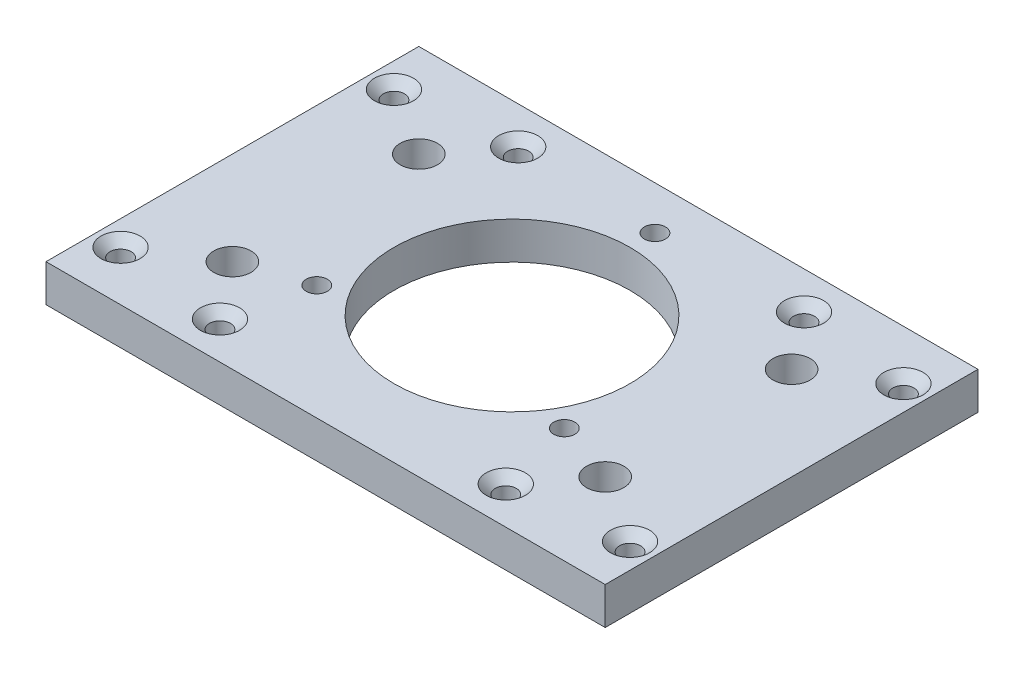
ISO-10303-21;
HEADER;
FILE_DESCRIPTION(('STEP AP214'),'2;1');
FILE_NAME('part.step','',(''),(''),'','','');
FILE_SCHEMA(('AUTOMOTIVE_DESIGN { 1 0 10303 214 1 1 1 1 }'));
ENDSEC;
DATA;
#1=APPLICATION_CONTEXT('core data for automotive mechanical design processes');
#2=APPLICATION_PROTOCOL_DEFINITION('international standard','automotive_design',2000,#1);
#3=PRODUCT_CONTEXT('',#1,'mechanical');
#4=PRODUCT('Part','Part','',(#3));
#5=PRODUCT_RELATED_PRODUCT_CATEGORY('part','',(#4));
#6=PRODUCT_DEFINITION_FORMATION('','',#4);
#7=PRODUCT_DEFINITION_CONTEXT('part definition',#1,'design');
#8=PRODUCT_DEFINITION('design','',#6,#7);
#9=PRODUCT_DEFINITION_SHAPE('','',#8);
#10=(LENGTH_UNIT() NAMED_UNIT(*) SI_UNIT(.MILLI.,.METRE.));
#11=(NAMED_UNIT(*) PLANE_ANGLE_UNIT() SI_UNIT($,.RADIAN.));
#12=(NAMED_UNIT(*) SI_UNIT($,.STERADIAN.) SOLID_ANGLE_UNIT());
#13=UNCERTAINTY_MEASURE_WITH_UNIT(LENGTH_MEASURE(1.E-05),#10,'distance_accuracy_value','');
#14=(GEOMETRIC_REPRESENTATION_CONTEXT(3) GLOBAL_UNCERTAINTY_ASSIGNED_CONTEXT((#13)) GLOBAL_UNIT_ASSIGNED_CONTEXT((#10,
#11,#12)) REPRESENTATION_CONTEXT('',''));
#15=CARTESIAN_POINT('',(0.,0.,0.));
#16=DIRECTION('',(0.,0.,1.));
#17=DIRECTION('',(1.,0.,0.));
#18=AXIS2_PLACEMENT_3D('',#15,#16,#17);
#19=CARTESIAN_POINT('',(45.,-3.,-30.));
#20=DIRECTION('',(0.,0.,1.));
#21=DIRECTION('',(1.,0.,0.));
#22=AXIS2_PLACEMENT_3D('',#19,#20,#21);
#23=PLANE('',#22);
#24=DIRECTION('',(0.,1.,0.));
#25=VECTOR('',#24,1.);
#26=CARTESIAN_POINT('',(-45.,-3.,-30.));
#27=LINE('',#26,#25);
#28=CARTESIAN_POINT('',(-45.,-3.,-30.));
#29=VERTEX_POINT('',#28);
#30=CARTESIAN_POINT('',(-45.,3.,-30.));
#31=VERTEX_POINT('',#30);
#32=EDGE_CURVE('E95',#29,#31,#27,.T.);
#33=ORIENTED_EDGE('',*,*,#32,.T.);
#34=DIRECTION('',(-1.,0.,0.));
#35=VECTOR('',#34,1.);
#36=CARTESIAN_POINT('',(45.,3.,-30.));
#37=LINE('',#36,#35);
#38=CARTESIAN_POINT('',(45.,3.,-30.));
#39=VERTEX_POINT('',#38);
#40=EDGE_CURVE('E11',#39,#31,#37,.T.);
#41=ORIENTED_EDGE('',*,*,#40,.F.);
#42=DIRECTION('',(0.,1.,0.));
#43=VECTOR('',#42,1.);
#44=CARTESIAN_POINT('',(45.,-3.,-30.));
#45=LINE('',#44,#43);
#46=CARTESIAN_POINT('',(45.,-3.,-30.));
#47=VERTEX_POINT('',#46);
#48=EDGE_CURVE('E83',#47,#39,#45,.T.);
#49=ORIENTED_EDGE('',*,*,#48,.F.);
#50=DIRECTION('',(-1.,0.,0.));
#51=VECTOR('',#50,1.);
#52=CARTESIAN_POINT('',(45.,-3.,-30.));
#53=LINE('',#52,#51);
#54=EDGE_CURVE('E91',#47,#29,#53,.T.);
#55=ORIENTED_EDGE('',*,*,#54,.T.);
#56=EDGE_LOOP('',(#33,#41,#49,#55));
#57=FACE_BOUND('',#56,.T.);
#58=ADVANCED_FACE('F32',(#57),#23,.F.);
#59=CARTESIAN_POINT('',(45.,3.,30.));
#60=DIRECTION('',(0.,-1.,0.));
#61=DIRECTION('',(0.,0.,-1.));
#62=AXIS2_PLACEMENT_3D('',#59,#60,#61);
#63=PLANE('',#62);
#64=CARTESIAN_POINT('',(-30.,3.,-15.));
#65=DIRECTION('',(0.,1.,0.));
#66=DIRECTION('',(0.,0.,1.));
#67=AXIS2_PLACEMENT_3D('',#64,#65,#66);
#68=CIRCLE('',#67,3.);
#69=CARTESIAN_POINT('',(-30.,3.,-12.));
#70=VERTEX_POINT('',#69);
#71=EDGE_CURVE('E234',#70,#70,#68,.T.);
#72=ORIENTED_EDGE('',*,*,#71,.F.);
#73=EDGE_LOOP('',(#72));
#74=FACE_BOUND('',#73,.T.);
#75=CARTESIAN_POINT('',(-30.,3.,15.));
#76=DIRECTION('',(0.,1.,0.));
#77=DIRECTION('',(0.,0.,1.));
#78=AXIS2_PLACEMENT_3D('',#75,#76,#77);
#79=CIRCLE('',#78,3.);
#80=CARTESIAN_POINT('',(-30.,3.,18.));
#81=VERTEX_POINT('',#80);
#82=EDGE_CURVE('E228',#81,#81,#79,.T.);
#83=ORIENTED_EDGE('',*,*,#82,.F.);
#84=EDGE_LOOP('',(#83));
#85=FACE_BOUND('',#84,.T.);
#86=CARTESIAN_POINT('',(30.,3.,15.));
#87=DIRECTION('',(0.,1.,0.));
#88=DIRECTION('',(0.,0.,1.));
#89=AXIS2_PLACEMENT_3D('',#86,#87,#88);
#90=CIRCLE('',#89,3.);
#91=CARTESIAN_POINT('',(30.,3.,18.));
#92=VERTEX_POINT('',#91);
#93=EDGE_CURVE('E222',#92,#92,#90,.T.);
#94=ORIENTED_EDGE('',*,*,#93,.F.);
#95=EDGE_LOOP('',(#94));
#96=FACE_BOUND('',#95,.T.);
#97=CARTESIAN_POINT('',(30.,3.,-15.));
#98=DIRECTION('',(0.,1.,0.));
#99=DIRECTION('',(0.,0.,1.));
#100=AXIS2_PLACEMENT_3D('',#97,#98,#99);
#101=CIRCLE('',#100,3.);
#102=CARTESIAN_POINT('',(30.,3.,-12.));
#103=VERTEX_POINT('',#102);
#104=EDGE_CURVE('E216',#103,#103,#101,.T.);
#105=ORIENTED_EDGE('',*,*,#104,.F.);
#106=EDGE_LOOP('',(#105));
#107=FACE_BOUND('',#106,.T.);
#108=CARTESIAN_POINT('',(-19.9185842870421,3.,11.5));
#109=DIRECTION('',(0.,-1.,0.));
#110=DIRECTION('',(0.,0.,-1.));
#111=AXIS2_PLACEMENT_3D('',#108,#109,#110);
#112=CIRCLE('',#111,1.7);
#113=CARTESIAN_POINT('',(-19.9185842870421,3.,9.79999999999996));
#114=VERTEX_POINT('',#113);
#115=EDGE_CURVE('E204',#114,#114,#112,.T.);
#116=ORIENTED_EDGE('',*,*,#115,.T.);
#117=EDGE_LOOP('',(#116));
#118=FACE_BOUND('',#117,.T.);
#119=CARTESIAN_POINT('',(19.9185842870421,3.,11.4999999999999));
#120=DIRECTION('',(0.,-1.,0.));
#121=DIRECTION('',(0.,0.,-1.));
#122=AXIS2_PLACEMENT_3D('',#119,#120,#121);
#123=CIRCLE('',#122,1.7);
#124=CARTESIAN_POINT('',(19.9185842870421,3.,9.79999999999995));
#125=VERTEX_POINT('',#124);
#126=EDGE_CURVE('E195',#125,#125,#123,.T.);
#127=ORIENTED_EDGE('',*,*,#126,.T.);
#128=EDGE_LOOP('',(#127));
#129=FACE_BOUND('',#128,.T.);
#130=CARTESIAN_POINT('',(0.,3.,-23.));
#131=DIRECTION('',(0.,-1.,0.));
#132=DIRECTION('',(0.,0.,-1.));
#133=AXIS2_PLACEMENT_3D('',#130,#131,#132);
#134=CIRCLE('',#133,1.7);
#135=CARTESIAN_POINT('',(0.,3.,-24.7));
#136=VERTEX_POINT('',#135);
#137=EDGE_CURVE('E186',#136,#136,#134,.T.);
#138=ORIENTED_EDGE('',*,*,#137,.T.);
#139=EDGE_LOOP('',(#138));
#140=FACE_BOUND('',#139,.T.);
#141=CARTESIAN_POINT('',(-41.,3.,-22.));
#142=DIRECTION('',(0.,1.,0.));
#143=DIRECTION('',(0.,0.,1.));
#144=AXIS2_PLACEMENT_3D('',#141,#142,#143);
#145=CIRCLE('',#144,3.15);
#146=CARTESIAN_POINT('',(-41.,3.,-18.85));
#147=VERTEX_POINT('',#146);
#148=EDGE_CURVE('E183',#147,#147,#145,.T.);
#149=ORIENTED_EDGE('',*,*,#148,.F.);
#150=EDGE_LOOP('',(#149));
#151=FACE_BOUND('',#150,.T.);
#152=CARTESIAN_POINT('',(41.,3.,-22.));
#153=DIRECTION('',(0.,1.,0.));
#154=DIRECTION('',(0.,0.,1.));
#155=AXIS2_PLACEMENT_3D('',#152,#153,#154);
#156=CIRCLE('',#155,3.15);
#157=CARTESIAN_POINT('',(41.,3.,-18.85));
#158=VERTEX_POINT('',#157);
#159=EDGE_CURVE('E174',#158,#158,#156,.T.);
#160=ORIENTED_EDGE('',*,*,#159,.F.);
#161=EDGE_LOOP('',(#160));
#162=FACE_BOUND('',#161,.T.);
#163=CARTESIAN_POINT('',(41.,3.,22.));
#164=DIRECTION('',(0.,1.,0.));
#165=DIRECTION('',(0.,0.,1.));
#166=AXIS2_PLACEMENT_3D('',#163,#164,#165);
#167=CIRCLE('',#166,3.15);
#168=CARTESIAN_POINT('',(41.,3.,25.15));
#169=VERTEX_POINT('',#168);
#170=EDGE_CURVE('E165',#169,#169,#167,.T.);
#171=ORIENTED_EDGE('',*,*,#170,.F.);
#172=EDGE_LOOP('',(#171));
#173=FACE_BOUND('',#172,.T.);
#174=CARTESIAN_POINT('',(-41.,3.,22.));
#175=DIRECTION('',(0.,1.,0.));
#176=DIRECTION('',(0.,0.,1.));
#177=AXIS2_PLACEMENT_3D('',#174,#175,#176);
#178=CIRCLE('',#177,3.15);
#179=CARTESIAN_POINT('',(-41.,3.,25.15));
#180=VERTEX_POINT('',#179);
#181=EDGE_CURVE('E156',#180,#180,#178,.T.);
#182=ORIENTED_EDGE('',*,*,#181,.F.);
#183=EDGE_LOOP('',(#182));
#184=FACE_BOUND('',#183,.T.);
#185=CARTESIAN_POINT('',(-23.,3.,-24.));
#186=DIRECTION('',(0.,1.,0.));
#187=DIRECTION('',(0.,0.,1.));
#188=AXIS2_PLACEMENT_3D('',#185,#186,#187);
#189=CIRCLE('',#188,3.15);
#190=CARTESIAN_POINT('',(-23.,3.,-20.85));
#191=VERTEX_POINT('',#190);
#192=EDGE_CURVE('E147',#191,#191,#189,.T.);
#193=ORIENTED_EDGE('',*,*,#192,.F.);
#194=EDGE_LOOP('',(#193));
#195=FACE_BOUND('',#194,.T.);
#196=CARTESIAN_POINT('',(23.,3.,-24.));
#197=DIRECTION('',(0.,1.,0.));
#198=DIRECTION('',(0.,0.,1.));
#199=AXIS2_PLACEMENT_3D('',#196,#197,#198);
#200=CIRCLE('',#199,3.15);
#201=CARTESIAN_POINT('',(23.,3.,-20.85));
#202=VERTEX_POINT('',#201);
#203=EDGE_CURVE('E138',#202,#202,#200,.T.);
#204=ORIENTED_EDGE('',*,*,#203,.F.);
#205=EDGE_LOOP('',(#204));
#206=FACE_BOUND('',#205,.T.);
#207=CARTESIAN_POINT('',(23.,3.,24.));
#208=DIRECTION('',(0.,1.,0.));
#209=DIRECTION('',(0.,0.,1.));
#210=AXIS2_PLACEMENT_3D('',#207,#208,#209);
#211=CIRCLE('',#210,3.15);
#212=CARTESIAN_POINT('',(23.,3.,27.15));
#213=VERTEX_POINT('',#212);
#214=EDGE_CURVE('E129',#213,#213,#211,.T.);
#215=ORIENTED_EDGE('',*,*,#214,.F.);
#216=EDGE_LOOP('',(#215));
#217=FACE_BOUND('',#216,.T.);
#218=CARTESIAN_POINT('',(-23.,3.,24.));
#219=DIRECTION('',(0.,1.,0.));
#220=DIRECTION('',(0.,0.,1.));
#221=AXIS2_PLACEMENT_3D('',#218,#219,#220);
#222=CIRCLE('',#221,3.15);
#223=CARTESIAN_POINT('',(-23.,3.,27.15));
#224=VERTEX_POINT('',#223);
#225=EDGE_CURVE('E120',#224,#224,#222,.T.);
#226=ORIENTED_EDGE('',*,*,#225,.F.);
#227=EDGE_LOOP('',(#226));
#228=FACE_BOUND('',#227,.T.);
#229=CARTESIAN_POINT('',(0.,3.,0.));
#230=DIRECTION('',(0.,1.,0.));
#231=DIRECTION('',(0.,0.,1.));
#232=AXIS2_PLACEMENT_3D('',#229,#230,#231);
#233=CIRCLE('',#232,19.);
#234=CARTESIAN_POINT('',(0.,3.,19.));
#235=VERTEX_POINT('',#234);
#236=EDGE_CURVE('E109',#235,#235,#233,.T.);
#237=ORIENTED_EDGE('',*,*,#236,.F.);
#238=EDGE_LOOP('',(#237));
#239=FACE_BOUND('',#238,.T.);
#240=DIRECTION('',(0.,0.,1.));
#241=VECTOR('',#240,1.);
#242=CARTESIAN_POINT('',(-45.,3.,30.));
#243=LINE('',#242,#241);
#244=CARTESIAN_POINT('',(-45.,3.,30.));
#245=VERTEX_POINT('',#244);
#246=EDGE_CURVE('E87',#31,#245,#243,.T.);
#247=ORIENTED_EDGE('',*,*,#246,.T.);
#248=DIRECTION('',(-1.,0.,0.));
#249=VECTOR('',#248,1.);
#250=CARTESIAN_POINT('',(45.,3.,30.));
#251=LINE('',#250,#249);
#252=CARTESIAN_POINT('',(45.,3.,30.));
#253=VERTEX_POINT('',#252);
#254=EDGE_CURVE('E40',#253,#245,#251,.T.);
#255=ORIENTED_EDGE('',*,*,#254,.F.);
#256=DIRECTION('',(0.,0.,1.));
#257=VECTOR('',#256,1.);
#258=CARTESIAN_POINT('',(45.,3.,30.));
#259=LINE('',#258,#257);
#260=EDGE_CURVE('E78',#39,#253,#259,.T.);
#261=ORIENTED_EDGE('',*,*,#260,.F.);
#262=ORIENTED_EDGE('',*,*,#40,.T.);
#263=EDGE_LOOP('',(#247,#255,#261,#262));
#264=FACE_BOUND('',#263,.T.);
#265=ADVANCED_FACE('F86',(#74,#85,#96,#107,#118,#129,#140,#151,#162,#173,#184,#195,#206,#217,
#228,#239,#264),#63,.F.);
#266=CARTESIAN_POINT('',(45.,-3.,30.));
#267=DIRECTION('',(0.,0.,-1.));
#268=DIRECTION('',(-1.,0.,0.));
#269=AXIS2_PLACEMENT_3D('',#266,#267,#268);
#270=PLANE('',#269);
#271=DIRECTION('',(0.,-1.,0.));
#272=VECTOR('',#271,1.);
#273=CARTESIAN_POINT('',(-45.,-3.,30.));
#274=LINE('',#273,#272);
#275=CARTESIAN_POINT('',(-45.,-3.,30.));
#276=VERTEX_POINT('',#275);
#277=EDGE_CURVE('E65',#245,#276,#274,.T.);
#278=ORIENTED_EDGE('',*,*,#277,.T.);
#279=DIRECTION('',(-1.,0.,0.));
#280=VECTOR('',#279,1.);
#281=CARTESIAN_POINT('',(45.,-3.,30.));
#282=LINE('',#281,#280);
#283=CARTESIAN_POINT('',(45.,-3.,30.));
#284=VERTEX_POINT('',#283);
#285=EDGE_CURVE('E88',#284,#276,#282,.T.);
#286=ORIENTED_EDGE('',*,*,#285,.F.);
#287=DIRECTION('',(0.,-1.,0.));
#288=VECTOR('',#287,1.);
#289=CARTESIAN_POINT('',(45.,-3.,30.));
#290=LINE('',#289,#288);
#291=EDGE_CURVE('E81',#253,#284,#290,.T.);
#292=ORIENTED_EDGE('',*,*,#291,.F.);
#293=ORIENTED_EDGE('',*,*,#254,.T.);
#294=EDGE_LOOP('',(#278,#286,#292,#293));
#295=FACE_BOUND('',#294,.T.);
#296=ADVANCED_FACE('F89',(#295),#270,.F.);
#297=CARTESIAN_POINT('',(45.,-3.,30.));
#298=DIRECTION('',(0.,1.,0.));
#299=DIRECTION('',(0.,0.,1.));
#300=AXIS2_PLACEMENT_3D('',#297,#298,#299);
#301=PLANE('',#300);
#302=CARTESIAN_POINT('',(-30.,-3.,-15.));
#303=DIRECTION('',(0.,1.,0.));
#304=DIRECTION('',(0.,0.,1.));
#305=AXIS2_PLACEMENT_3D('',#302,#303,#304);
#306=CIRCLE('',#305,3.);
#307=CARTESIAN_POINT('',(-30.,-3.,-12.));
#308=VERTEX_POINT('',#307);
#309=EDGE_CURVE('E231',#308,#308,#306,.T.);
#310=ORIENTED_EDGE('',*,*,#309,.T.);
#311=EDGE_LOOP('',(#310));
#312=FACE_BOUND('',#311,.T.);
#313=CARTESIAN_POINT('',(-30.,-3.,15.));
#314=DIRECTION('',(0.,1.,0.));
#315=DIRECTION('',(0.,0.,1.));
#316=AXIS2_PLACEMENT_3D('',#313,#314,#315);
#317=CIRCLE('',#316,3.);
#318=CARTESIAN_POINT('',(-30.,-3.,18.));
#319=VERTEX_POINT('',#318);
#320=EDGE_CURVE('E225',#319,#319,#317,.T.);
#321=ORIENTED_EDGE('',*,*,#320,.T.);
#322=EDGE_LOOP('',(#321));
#323=FACE_BOUND('',#322,.T.);
#324=CARTESIAN_POINT('',(30.,-3.,15.));
#325=DIRECTION('',(0.,1.,0.));
#326=DIRECTION('',(0.,0.,1.));
#327=AXIS2_PLACEMENT_3D('',#324,#325,#326);
#328=CIRCLE('',#327,3.);
#329=CARTESIAN_POINT('',(30.,-3.,18.));
#330=VERTEX_POINT('',#329);
#331=EDGE_CURVE('E219',#330,#330,#328,.T.);
#332=ORIENTED_EDGE('',*,*,#331,.T.);
#333=EDGE_LOOP('',(#332));
#334=FACE_BOUND('',#333,.T.);
#335=CARTESIAN_POINT('',(30.,-3.,-15.));
#336=DIRECTION('',(0.,1.,0.));
#337=DIRECTION('',(0.,0.,1.));
#338=AXIS2_PLACEMENT_3D('',#335,#336,#337);
#339=CIRCLE('',#338,3.);
#340=CARTESIAN_POINT('',(30.,-3.,-12.));
#341=VERTEX_POINT('',#340);
#342=EDGE_CURVE('E213',#341,#341,#339,.T.);
#343=ORIENTED_EDGE('',*,*,#342,.T.);
#344=EDGE_LOOP('',(#343));
#345=FACE_BOUND('',#344,.T.);
#346=CARTESIAN_POINT('',(-19.9185842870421,-3.,11.5));
#347=DIRECTION('',(0.,-1.,0.));
#348=DIRECTION('',(0.,0.,-1.));
#349=AXIS2_PLACEMENT_3D('',#346,#347,#348);
#350=CIRCLE('',#349,3.15);
#351=CARTESIAN_POINT('',(-19.9185842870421,-3.,8.34999999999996));
#352=VERTEX_POINT('',#351);
#353=EDGE_CURVE('E210',#352,#352,#350,.T.);
#354=ORIENTED_EDGE('',*,*,#353,.F.);
#355=EDGE_LOOP('',(#354));
#356=FACE_BOUND('',#355,.T.);
#357=CARTESIAN_POINT('',(19.9185842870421,-3.,11.4999999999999));
#358=DIRECTION('',(0.,-1.,0.));
#359=DIRECTION('',(0.,0.,-1.));
#360=AXIS2_PLACEMENT_3D('',#357,#358,#359);
#361=CIRCLE('',#360,3.15);
#362=CARTESIAN_POINT('',(19.9185842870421,-3.,8.34999999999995));
#363=VERTEX_POINT('',#362);
#364=EDGE_CURVE('E201',#363,#363,#361,.T.);
#365=ORIENTED_EDGE('',*,*,#364,.F.);
#366=EDGE_LOOP('',(#365));
#367=FACE_BOUND('',#366,.T.);
#368=CARTESIAN_POINT('',(0.,-3.,-23.));
#369=DIRECTION('',(0.,-1.,0.));
#370=DIRECTION('',(0.,0.,-1.));
#371=AXIS2_PLACEMENT_3D('',#368,#369,#370);
#372=CIRCLE('',#371,3.15);
#373=CARTESIAN_POINT('',(0.,-3.,-26.15));
#374=VERTEX_POINT('',#373);
#375=EDGE_CURVE('E192',#374,#374,#372,.T.);
#376=ORIENTED_EDGE('',*,*,#375,.F.);
#377=EDGE_LOOP('',(#376));
#378=FACE_BOUND('',#377,.T.);
#379=CARTESIAN_POINT('',(-41.,-3.,-22.));
#380=DIRECTION('',(0.,1.,0.));
#381=DIRECTION('',(0.,0.,1.));
#382=AXIS2_PLACEMENT_3D('',#379,#380,#381);
#383=CIRCLE('',#382,1.7);
#384=CARTESIAN_POINT('',(-41.,-3.,-20.3));
#385=VERTEX_POINT('',#384);
#386=EDGE_CURVE('E177',#385,#385,#383,.T.);
#387=ORIENTED_EDGE('',*,*,#386,.T.);
#388=EDGE_LOOP('',(#387));
#389=FACE_BOUND('',#388,.T.);
#390=CARTESIAN_POINT('',(41.,-3.,-22.));
#391=DIRECTION('',(0.,1.,0.));
#392=DIRECTION('',(0.,0.,1.));
#393=AXIS2_PLACEMENT_3D('',#390,#391,#392);
#394=CIRCLE('',#393,1.7);
#395=CARTESIAN_POINT('',(41.,-3.,-20.3));
#396=VERTEX_POINT('',#395);
#397=EDGE_CURVE('E168',#396,#396,#394,.T.);
#398=ORIENTED_EDGE('',*,*,#397,.T.);
#399=EDGE_LOOP('',(#398));
#400=FACE_BOUND('',#399,.T.);
#401=CARTESIAN_POINT('',(41.,-3.,22.));
#402=DIRECTION('',(0.,1.,0.));
#403=DIRECTION('',(0.,0.,1.));
#404=AXIS2_PLACEMENT_3D('',#401,#402,#403);
#405=CIRCLE('',#404,1.7);
#406=CARTESIAN_POINT('',(41.,-3.,23.7));
#407=VERTEX_POINT('',#406);
#408=EDGE_CURVE('E159',#407,#407,#405,.T.);
#409=ORIENTED_EDGE('',*,*,#408,.T.);
#410=EDGE_LOOP('',(#409));
#411=FACE_BOUND('',#410,.T.);
#412=CARTESIAN_POINT('',(-41.,-3.,22.));
#413=DIRECTION('',(0.,1.,0.));
#414=DIRECTION('',(0.,0.,1.));
#415=AXIS2_PLACEMENT_3D('',#412,#413,#414);
#416=CIRCLE('',#415,1.7);
#417=CARTESIAN_POINT('',(-41.,-3.,23.7));
#418=VERTEX_POINT('',#417);
#419=EDGE_CURVE('E150',#418,#418,#416,.T.);
#420=ORIENTED_EDGE('',*,*,#419,.T.);
#421=EDGE_LOOP('',(#420));
#422=FACE_BOUND('',#421,.T.);
#423=CARTESIAN_POINT('',(-23.,-3.,-24.));
#424=DIRECTION('',(0.,1.,0.));
#425=DIRECTION('',(0.,0.,1.));
#426=AXIS2_PLACEMENT_3D('',#423,#424,#425);
#427=CIRCLE('',#426,1.7);
#428=CARTESIAN_POINT('',(-23.,-3.,-22.3));
#429=VERTEX_POINT('',#428);
#430=EDGE_CURVE('E141',#429,#429,#427,.T.);
#431=ORIENTED_EDGE('',*,*,#430,.T.);
#432=EDGE_LOOP('',(#431));
#433=FACE_BOUND('',#432,.T.);
#434=CARTESIAN_POINT('',(23.,-3.,-24.));
#435=DIRECTION('',(0.,1.,0.));
#436=DIRECTION('',(0.,0.,1.));
#437=AXIS2_PLACEMENT_3D('',#434,#435,#436);
#438=CIRCLE('',#437,1.7);
#439=CARTESIAN_POINT('',(23.,-3.,-22.3));
#440=VERTEX_POINT('',#439);
#441=EDGE_CURVE('E132',#440,#440,#438,.T.);
#442=ORIENTED_EDGE('',*,*,#441,.T.);
#443=EDGE_LOOP('',(#442));
#444=FACE_BOUND('',#443,.T.);
#445=CARTESIAN_POINT('',(23.,-3.,24.));
#446=DIRECTION('',(0.,1.,0.));
#447=DIRECTION('',(0.,0.,1.));
#448=AXIS2_PLACEMENT_3D('',#445,#446,#447);
#449=CIRCLE('',#448,1.7);
#450=CARTESIAN_POINT('',(23.,-3.,25.7));
#451=VERTEX_POINT('',#450);
#452=EDGE_CURVE('E123',#451,#451,#449,.T.);
#453=ORIENTED_EDGE('',*,*,#452,.T.);
#454=EDGE_LOOP('',(#453));
#455=FACE_BOUND('',#454,.T.);
#456=CARTESIAN_POINT('',(-23.,-3.,24.));
#457=DIRECTION('',(0.,1.,0.));
#458=DIRECTION('',(0.,0.,1.));
#459=AXIS2_PLACEMENT_3D('',#456,#457,#458);
#460=CIRCLE('',#459,1.7);
#461=CARTESIAN_POINT('',(-23.,-3.,25.7));
#462=VERTEX_POINT('',#461);
#463=EDGE_CURVE('E112',#462,#462,#460,.T.);
#464=ORIENTED_EDGE('',*,*,#463,.T.);
#465=EDGE_LOOP('',(#464));
#466=FACE_BOUND('',#465,.T.);
#467=CARTESIAN_POINT('',(0.,-3.,0.));
#468=DIRECTION('',(0.,1.,0.));
#469=DIRECTION('',(0.,0.,1.));
#470=AXIS2_PLACEMENT_3D('',#467,#468,#469);
#471=CIRCLE('',#470,19.);
#472=CARTESIAN_POINT('',(0.,-3.,19.));
#473=VERTEX_POINT('',#472);
#474=EDGE_CURVE('E98',#473,#473,#471,.T.);
#475=ORIENTED_EDGE('',*,*,#474,.T.);
#476=EDGE_LOOP('',(#475));
#477=FACE_BOUND('',#476,.T.);
#478=DIRECTION('',(0.,0.,-1.));
#479=VECTOR('',#478,1.);
#480=CARTESIAN_POINT('',(-45.,-3.,30.));
#481=LINE('',#480,#479);
#482=EDGE_CURVE('E71',#276,#29,#481,.T.);
#483=ORIENTED_EDGE('',*,*,#482,.T.);
#484=ORIENTED_EDGE('',*,*,#54,.F.);
#485=DIRECTION('',(0.,0.,-1.));
#486=VECTOR('',#485,1.);
#487=CARTESIAN_POINT('',(45.,-3.,30.));
#488=LINE('',#487,#486);
#489=EDGE_CURVE('E48',#284,#47,#488,.T.);
#490=ORIENTED_EDGE('',*,*,#489,.F.);
#491=ORIENTED_EDGE('',*,*,#285,.T.);
#492=EDGE_LOOP('',(#483,#484,#490,#491));
#493=FACE_BOUND('',#492,.T.);
#494=ADVANCED_FACE('F103',(#312,#323,#334,#345,#356,#367,#378,#389,#400,#411,#422,#433,#444,
#455,#466,#477,#493),#301,.F.);
#495=CARTESIAN_POINT('',(45.,0.,0.));
#496=DIRECTION('',(-1.,0.,0.));
#497=DIRECTION('',(0.,0.,1.));
#498=AXIS2_PLACEMENT_3D('',#495,#496,#497);
#499=PLANE('',#498);
#500=ORIENTED_EDGE('',*,*,#48,.T.);
#501=ORIENTED_EDGE('',*,*,#260,.T.);
#502=ORIENTED_EDGE('',*,*,#291,.T.);
#503=ORIENTED_EDGE('',*,*,#489,.T.);
#504=EDGE_LOOP('',(#500,#501,#502,#503));
#505=FACE_BOUND('',#504,.T.);
#506=ADVANCED_FACE('F79',(#505),#499,.F.);
#507=CARTESIAN_POINT('',(-45.,0.,0.));
#508=DIRECTION('',(-1.,0.,0.));
#509=DIRECTION('',(0.,0.,1.));
#510=AXIS2_PLACEMENT_3D('',#507,#508,#509);
#511=PLANE('',#510);
#512=ORIENTED_EDGE('',*,*,#32,.F.);
#513=ORIENTED_EDGE('',*,*,#482,.F.);
#514=ORIENTED_EDGE('',*,*,#277,.F.);
#515=ORIENTED_EDGE('',*,*,#246,.F.);
#516=EDGE_LOOP('',(#512,#513,#514,#515));
#517=FACE_BOUND('',#516,.T.);
#518=ADVANCED_FACE('F106',(#517),#511,.T.);
#519=CARTESIAN_POINT('',(0.,-3.,0.));
#520=DIRECTION('',(0.,1.,0.));
#521=DIRECTION('',(0.,0.,1.));
#522=AXIS2_PLACEMENT_3D('',#519,#520,#521);
#523=CYLINDRICAL_SURFACE('',#522,19.);
#524=ORIENTED_EDGE('',*,*,#474,.F.);
#525=EDGE_LOOP('',(#524));
#526=FACE_BOUND('',#525,.T.);
#527=ORIENTED_EDGE('',*,*,#236,.T.);
#528=EDGE_LOOP('',(#527));
#529=FACE_BOUND('',#528,.T.);
#530=ADVANCED_FACE('F272',(#526,#529),#523,.F.);
#531=CARTESIAN_POINT('',(-23.,3.,24.));
#532=DIRECTION('',(0.,1.,0.));
#533=DIRECTION('',(0.,0.,1.));
#534=AXIS2_PLACEMENT_3D('',#531,#532,#533);
#535=CYLINDRICAL_SURFACE('',#534,1.69999999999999);
#536=ORIENTED_EDGE('',*,*,#463,.F.);
#537=EDGE_LOOP('',(#536));
#538=FACE_BOUND('',#537,.T.);
#539=CARTESIAN_POINT('',(-23.,1.54999999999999,24.));
#540=DIRECTION('',(0.,1.,0.));
#541=DIRECTION('',(0.,0.,1.));
#542=AXIS2_PLACEMENT_3D('',#539,#540,#541);
#543=CIRCLE('',#542,1.69999999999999);
#544=CARTESIAN_POINT('',(-23.,1.54999999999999,25.7));
#545=VERTEX_POINT('',#544);
#546=EDGE_CURVE('E117',#545,#545,#543,.T.);
#547=ORIENTED_EDGE('',*,*,#546,.T.);
#548=EDGE_LOOP('',(#547));
#549=FACE_BOUND('',#548,.T.);
#550=ADVANCED_FACE('F274',(#538,#549),#535,.F.);
#551=CARTESIAN_POINT('',(-23.,3.,24.));
#552=DIRECTION('',(0.,1.,0.));
#553=DIRECTION('',(0.,0.,1.));
#554=AXIS2_PLACEMENT_3D('',#551,#552,#553);
#555=CONICAL_SURFACE('',#554,3.15,0.785398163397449);
#556=ORIENTED_EDGE('',*,*,#546,.F.);
#557=EDGE_LOOP('',(#556));
#558=FACE_BOUND('',#557,.T.);
#559=ORIENTED_EDGE('',*,*,#225,.T.);
#560=EDGE_LOOP('',(#559));
#561=FACE_BOUND('',#560,.T.);
#562=ADVANCED_FACE('F281',(#558,#561),#555,.F.);
#563=CARTESIAN_POINT('',(23.,3.,24.));
#564=DIRECTION('',(0.,1.,0.));
#565=DIRECTION('',(0.,0.,1.));
#566=AXIS2_PLACEMENT_3D('',#563,#564,#565);
#567=CYLINDRICAL_SURFACE('',#566,1.69999999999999);
#568=ORIENTED_EDGE('',*,*,#452,.F.);
#569=EDGE_LOOP('',(#568));
#570=FACE_BOUND('',#569,.T.);
#571=CARTESIAN_POINT('',(23.,1.54999999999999,24.));
#572=DIRECTION('',(0.,1.,0.));
#573=DIRECTION('',(0.,0.,1.));
#574=AXIS2_PLACEMENT_3D('',#571,#572,#573);
#575=CIRCLE('',#574,1.69999999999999);
#576=CARTESIAN_POINT('',(23.,1.54999999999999,25.7));
#577=VERTEX_POINT('',#576);
#578=EDGE_CURVE('E126',#577,#577,#575,.T.);
#579=ORIENTED_EDGE('',*,*,#578,.T.);
#580=EDGE_LOOP('',(#579));
#581=FACE_BOUND('',#580,.T.);
#582=ADVANCED_FACE('F337',(#570,#581),#567,.F.);
#583=CARTESIAN_POINT('',(23.,3.,24.));
#584=DIRECTION('',(0.,1.,0.));
#585=DIRECTION('',(0.,0.,1.));
#586=AXIS2_PLACEMENT_3D('',#583,#584,#585);
#587=CONICAL_SURFACE('',#586,3.15,0.785398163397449);
#588=ORIENTED_EDGE('',*,*,#578,.F.);
#589=EDGE_LOOP('',(#588));
#590=FACE_BOUND('',#589,.T.);
#591=ORIENTED_EDGE('',*,*,#214,.T.);
#592=EDGE_LOOP('',(#591));
#593=FACE_BOUND('',#592,.T.);
#594=ADVANCED_FACE('F347',(#590,#593),#587,.F.);
#595=CARTESIAN_POINT('',(23.,3.,-24.));
#596=DIRECTION('',(0.,1.,0.));
#597=DIRECTION('',(0.,0.,1.));
#598=AXIS2_PLACEMENT_3D('',#595,#596,#597);
#599=CYLINDRICAL_SURFACE('',#598,1.69999999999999);
#600=ORIENTED_EDGE('',*,*,#441,.F.);
#601=EDGE_LOOP('',(#600));
#602=FACE_BOUND('',#601,.T.);
#603=CARTESIAN_POINT('',(23.,1.54999999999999,-24.));
#604=DIRECTION('',(0.,1.,0.));
#605=DIRECTION('',(0.,0.,1.));
#606=AXIS2_PLACEMENT_3D('',#603,#604,#605);
#607=CIRCLE('',#606,1.69999999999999);
#608=CARTESIAN_POINT('',(23.,1.54999999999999,-22.3));
#609=VERTEX_POINT('',#608);
#610=EDGE_CURVE('E135',#609,#609,#607,.T.);
#611=ORIENTED_EDGE('',*,*,#610,.T.);
#612=EDGE_LOOP('',(#611));
#613=FACE_BOUND('',#612,.T.);
#614=ADVANCED_FACE('F357',(#602,#613),#599,.F.);
#615=CARTESIAN_POINT('',(23.,3.,-24.));
#616=DIRECTION('',(0.,1.,0.));
#617=DIRECTION('',(0.,0.,1.));
#618=AXIS2_PLACEMENT_3D('',#615,#616,#617);
#619=CONICAL_SURFACE('',#618,3.15,0.785398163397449);
#620=ORIENTED_EDGE('',*,*,#610,.F.);
#621=EDGE_LOOP('',(#620));
#622=FACE_BOUND('',#621,.T.);
#623=ORIENTED_EDGE('',*,*,#203,.T.);
#624=EDGE_LOOP('',(#623));
#625=FACE_BOUND('',#624,.T.);
#626=ADVANCED_FACE('F367',(#622,#625),#619,.F.);
#627=CARTESIAN_POINT('',(-23.,3.,-24.));
#628=DIRECTION('',(0.,1.,0.));
#629=DIRECTION('',(0.,0.,1.));
#630=AXIS2_PLACEMENT_3D('',#627,#628,#629);
#631=CYLINDRICAL_SURFACE('',#630,1.69999999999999);
#632=ORIENTED_EDGE('',*,*,#430,.F.);
#633=EDGE_LOOP('',(#632));
#634=FACE_BOUND('',#633,.T.);
#635=CARTESIAN_POINT('',(-23.,1.54999999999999,-24.));
#636=DIRECTION('',(0.,1.,0.));
#637=DIRECTION('',(0.,0.,1.));
#638=AXIS2_PLACEMENT_3D('',#635,#636,#637);
#639=CIRCLE('',#638,1.69999999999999);
#640=CARTESIAN_POINT('',(-23.,1.54999999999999,-22.3));
#641=VERTEX_POINT('',#640);
#642=EDGE_CURVE('E144',#641,#641,#639,.T.);
#643=ORIENTED_EDGE('',*,*,#642,.T.);
#644=EDGE_LOOP('',(#643));
#645=FACE_BOUND('',#644,.T.);
#646=ADVANCED_FACE('F377',(#634,#645),#631,.F.);
#647=CARTESIAN_POINT('',(-23.,3.,-24.));
#648=DIRECTION('',(0.,1.,0.));
#649=DIRECTION('',(0.,0.,1.));
#650=AXIS2_PLACEMENT_3D('',#647,#648,#649);
#651=CONICAL_SURFACE('',#650,3.15,0.785398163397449);
#652=ORIENTED_EDGE('',*,*,#642,.F.);
#653=EDGE_LOOP('',(#652));
#654=FACE_BOUND('',#653,.T.);
#655=ORIENTED_EDGE('',*,*,#192,.T.);
#656=EDGE_LOOP('',(#655));
#657=FACE_BOUND('',#656,.T.);
#658=ADVANCED_FACE('F387',(#654,#657),#651,.F.);
#659=CARTESIAN_POINT('',(-41.,3.,22.));
#660=DIRECTION('',(0.,1.,0.));
#661=DIRECTION('',(0.,0.,1.));
#662=AXIS2_PLACEMENT_3D('',#659,#660,#661);
#663=CYLINDRICAL_SURFACE('',#662,1.69999999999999);
#664=ORIENTED_EDGE('',*,*,#419,.F.);
#665=EDGE_LOOP('',(#664));
#666=FACE_BOUND('',#665,.T.);
#667=CARTESIAN_POINT('',(-41.,1.54999999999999,22.));
#668=DIRECTION('',(0.,1.,0.));
#669=DIRECTION('',(0.,0.,1.));
#670=AXIS2_PLACEMENT_3D('',#667,#668,#669);
#671=CIRCLE('',#670,1.69999999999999);
#672=CARTESIAN_POINT('',(-41.,1.54999999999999,23.7));
#673=VERTEX_POINT('',#672);
#674=EDGE_CURVE('E153',#673,#673,#671,.T.);
#675=ORIENTED_EDGE('',*,*,#674,.T.);
#676=EDGE_LOOP('',(#675));
#677=FACE_BOUND('',#676,.T.);
#678=ADVANCED_FACE('F397',(#666,#677),#663,.F.);
#679=CARTESIAN_POINT('',(-41.,3.,22.));
#680=DIRECTION('',(0.,1.,0.));
#681=DIRECTION('',(0.,0.,1.));
#682=AXIS2_PLACEMENT_3D('',#679,#680,#681);
#683=CONICAL_SURFACE('',#682,3.15,0.78539816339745);
#684=ORIENTED_EDGE('',*,*,#674,.F.);
#685=EDGE_LOOP('',(#684));
#686=FACE_BOUND('',#685,.T.);
#687=ORIENTED_EDGE('',*,*,#181,.T.);
#688=EDGE_LOOP('',(#687));
#689=FACE_BOUND('',#688,.T.);
#690=ADVANCED_FACE('F407',(#686,#689),#683,.F.);
#691=CARTESIAN_POINT('',(41.,3.,22.));
#692=DIRECTION('',(0.,1.,0.));
#693=DIRECTION('',(0.,0.,1.));
#694=AXIS2_PLACEMENT_3D('',#691,#692,#693);
#695=CYLINDRICAL_SURFACE('',#694,1.69999999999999);
#696=ORIENTED_EDGE('',*,*,#408,.F.);
#697=EDGE_LOOP('',(#696));
#698=FACE_BOUND('',#697,.T.);
#699=CARTESIAN_POINT('',(41.,1.54999999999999,22.));
#700=DIRECTION('',(0.,1.,0.));
#701=DIRECTION('',(0.,0.,1.));
#702=AXIS2_PLACEMENT_3D('',#699,#700,#701);
#703=CIRCLE('',#702,1.69999999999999);
#704=CARTESIAN_POINT('',(41.,1.54999999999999,23.7));
#705=VERTEX_POINT('',#704);
#706=EDGE_CURVE('E162',#705,#705,#703,.T.);
#707=ORIENTED_EDGE('',*,*,#706,.T.);
#708=EDGE_LOOP('',(#707));
#709=FACE_BOUND('',#708,.T.);
#710=ADVANCED_FACE('F417',(#698,#709),#695,.F.);
#711=CARTESIAN_POINT('',(41.,3.,22.));
#712=DIRECTION('',(0.,1.,0.));
#713=DIRECTION('',(0.,0.,1.));
#714=AXIS2_PLACEMENT_3D('',#711,#712,#713);
#715=CONICAL_SURFACE('',#714,3.15,0.78539816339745);
#716=ORIENTED_EDGE('',*,*,#706,.F.);
#717=EDGE_LOOP('',(#716));
#718=FACE_BOUND('',#717,.T.);
#719=ORIENTED_EDGE('',*,*,#170,.T.);
#720=EDGE_LOOP('',(#719));
#721=FACE_BOUND('',#720,.T.);
#722=ADVANCED_FACE('F427',(#718,#721),#715,.F.);
#723=CARTESIAN_POINT('',(41.,3.,-22.));
#724=DIRECTION('',(0.,1.,0.));
#725=DIRECTION('',(0.,0.,1.));
#726=AXIS2_PLACEMENT_3D('',#723,#724,#725);
#727=CYLINDRICAL_SURFACE('',#726,1.69999999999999);
#728=ORIENTED_EDGE('',*,*,#397,.F.);
#729=EDGE_LOOP('',(#728));
#730=FACE_BOUND('',#729,.T.);
#731=CARTESIAN_POINT('',(41.,1.54999999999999,-22.));
#732=DIRECTION('',(0.,1.,0.));
#733=DIRECTION('',(0.,0.,1.));
#734=AXIS2_PLACEMENT_3D('',#731,#732,#733);
#735=CIRCLE('',#734,1.69999999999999);
#736=CARTESIAN_POINT('',(41.,1.54999999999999,-20.3));
#737=VERTEX_POINT('',#736);
#738=EDGE_CURVE('E171',#737,#737,#735,.T.);
#739=ORIENTED_EDGE('',*,*,#738,.T.);
#740=EDGE_LOOP('',(#739));
#741=FACE_BOUND('',#740,.T.);
#742=ADVANCED_FACE('F437',(#730,#741),#727,.F.);
#743=CARTESIAN_POINT('',(41.,3.,-22.));
#744=DIRECTION('',(0.,1.,0.));
#745=DIRECTION('',(0.,0.,1.));
#746=AXIS2_PLACEMENT_3D('',#743,#744,#745);
#747=CONICAL_SURFACE('',#746,3.15,0.78539816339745);
#748=ORIENTED_EDGE('',*,*,#738,.F.);
#749=EDGE_LOOP('',(#748));
#750=FACE_BOUND('',#749,.T.);
#751=ORIENTED_EDGE('',*,*,#159,.T.);
#752=EDGE_LOOP('',(#751));
#753=FACE_BOUND('',#752,.T.);
#754=ADVANCED_FACE('F447',(#750,#753),#747,.F.);
#755=CARTESIAN_POINT('',(-41.,3.,-22.));
#756=DIRECTION('',(0.,1.,0.));
#757=DIRECTION('',(0.,0.,1.));
#758=AXIS2_PLACEMENT_3D('',#755,#756,#757);
#759=CYLINDRICAL_SURFACE('',#758,1.69999999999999);
#760=ORIENTED_EDGE('',*,*,#386,.F.);
#761=EDGE_LOOP('',(#760));
#762=FACE_BOUND('',#761,.T.);
#763=CARTESIAN_POINT('',(-41.,1.54999999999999,-22.));
#764=DIRECTION('',(0.,1.,0.));
#765=DIRECTION('',(0.,0.,1.));
#766=AXIS2_PLACEMENT_3D('',#763,#764,#765);
#767=CIRCLE('',#766,1.69999999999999);
#768=CARTESIAN_POINT('',(-41.,1.54999999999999,-20.3));
#769=VERTEX_POINT('',#768);
#770=EDGE_CURVE('E180',#769,#769,#767,.T.);
#771=ORIENTED_EDGE('',*,*,#770,.T.);
#772=EDGE_LOOP('',(#771));
#773=FACE_BOUND('',#772,.T.);
#774=ADVANCED_FACE('F457',(#762,#773),#759,.F.);
#775=CARTESIAN_POINT('',(-41.,3.,-22.));
#776=DIRECTION('',(0.,1.,0.));
#777=DIRECTION('',(0.,0.,1.));
#778=AXIS2_PLACEMENT_3D('',#775,#776,#777);
#779=CONICAL_SURFACE('',#778,3.15,0.78539816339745);
#780=ORIENTED_EDGE('',*,*,#770,.F.);
#781=EDGE_LOOP('',(#780));
#782=FACE_BOUND('',#781,.T.);
#783=ORIENTED_EDGE('',*,*,#148,.T.);
#784=EDGE_LOOP('',(#783));
#785=FACE_BOUND('',#784,.T.);
#786=ADVANCED_FACE('F467',(#782,#785),#779,.F.);
#787=CARTESIAN_POINT('',(0.,-3.,-23.));
#788=DIRECTION('',(0.,-1.,0.));
#789=DIRECTION('',(0.,0.,-1.));
#790=AXIS2_PLACEMENT_3D('',#787,#788,#789);
#791=CYLINDRICAL_SURFACE('',#790,1.69999999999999);
#792=ORIENTED_EDGE('',*,*,#137,.F.);
#793=EDGE_LOOP('',(#792));
#794=FACE_BOUND('',#793,.T.);
#795=CARTESIAN_POINT('',(0.,-1.54999999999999,-23.));
#796=DIRECTION('',(0.,-1.,0.));
#797=DIRECTION('',(0.,0.,-1.));
#798=AXIS2_PLACEMENT_3D('',#795,#796,#797);
#799=CIRCLE('',#798,1.69999999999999);
#800=CARTESIAN_POINT('',(0.,-1.54999999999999,-24.7));
#801=VERTEX_POINT('',#800);
#802=EDGE_CURVE('E189',#801,#801,#799,.T.);
#803=ORIENTED_EDGE('',*,*,#802,.T.);
#804=EDGE_LOOP('',(#803));
#805=FACE_BOUND('',#804,.T.);
#806=ADVANCED_FACE('F477',(#794,#805),#791,.F.);
#807=CARTESIAN_POINT('',(0.,-3.,-23.));
#808=DIRECTION('',(0.,-1.,0.));
#809=DIRECTION('',(0.,0.,-1.));
#810=AXIS2_PLACEMENT_3D('',#807,#808,#809);
#811=CONICAL_SURFACE('',#810,3.15,0.78539816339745);
#812=ORIENTED_EDGE('',*,*,#802,.F.);
#813=EDGE_LOOP('',(#812));
#814=FACE_BOUND('',#813,.T.);
#815=ORIENTED_EDGE('',*,*,#375,.T.);
#816=EDGE_LOOP('',(#815));
#817=FACE_BOUND('',#816,.T.);
#818=ADVANCED_FACE('F487',(#814,#817),#811,.F.);
#819=CARTESIAN_POINT('',(19.9185842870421,-3.,11.4999999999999));
#820=DIRECTION('',(0.,-1.,0.));
#821=DIRECTION('',(0.,0.,-1.));
#822=AXIS2_PLACEMENT_3D('',#819,#820,#821);
#823=CYLINDRICAL_SURFACE('',#822,1.69999999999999);
#824=ORIENTED_EDGE('',*,*,#126,.F.);
#825=EDGE_LOOP('',(#824));
#826=FACE_BOUND('',#825,.T.);
#827=CARTESIAN_POINT('',(19.9185842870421,-1.54999999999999,11.4999999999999));
#828=DIRECTION('',(0.,-1.,0.));
#829=DIRECTION('',(0.,0.,-1.));
#830=AXIS2_PLACEMENT_3D('',#827,#828,#829);
#831=CIRCLE('',#830,1.69999999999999);
#832=CARTESIAN_POINT('',(19.9185842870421,-1.54999999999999,9.79999999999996));
#833=VERTEX_POINT('',#832);
#834=EDGE_CURVE('E198',#833,#833,#831,.T.);
#835=ORIENTED_EDGE('',*,*,#834,.T.);
#836=EDGE_LOOP('',(#835));
#837=FACE_BOUND('',#836,.T.);
#838=ADVANCED_FACE('F497',(#826,#837),#823,.F.);
#839=CARTESIAN_POINT('',(19.9185842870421,-3.,11.4999999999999));
#840=DIRECTION('',(0.,-1.,0.));
#841=DIRECTION('',(0.,0.,-1.));
#842=AXIS2_PLACEMENT_3D('',#839,#840,#841);
#843=CONICAL_SURFACE('',#842,3.15,0.78539816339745);
#844=ORIENTED_EDGE('',*,*,#834,.F.);
#845=EDGE_LOOP('',(#844));
#846=FACE_BOUND('',#845,.T.);
#847=ORIENTED_EDGE('',*,*,#364,.T.);
#848=EDGE_LOOP('',(#847));
#849=FACE_BOUND('',#848,.T.);
#850=ADVANCED_FACE('F507',(#846,#849),#843,.F.);
#851=CARTESIAN_POINT('',(-19.9185842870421,-3.,11.5));
#852=DIRECTION('',(0.,-1.,0.));
#853=DIRECTION('',(0.,0.,-1.));
#854=AXIS2_PLACEMENT_3D('',#851,#852,#853);
#855=CYLINDRICAL_SURFACE('',#854,1.69999999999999);
#856=ORIENTED_EDGE('',*,*,#115,.F.);
#857=EDGE_LOOP('',(#856));
#858=FACE_BOUND('',#857,.T.);
#859=CARTESIAN_POINT('',(-19.9185842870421,-1.54999999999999,11.5));
#860=DIRECTION('',(0.,-1.,0.));
#861=DIRECTION('',(0.,0.,-1.));
#862=AXIS2_PLACEMENT_3D('',#859,#860,#861);
#863=CIRCLE('',#862,1.69999999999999);
#864=CARTESIAN_POINT('',(-19.9185842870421,-1.54999999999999,9.79999999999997));
#865=VERTEX_POINT('',#864);
#866=EDGE_CURVE('E207',#865,#865,#863,.T.);
#867=ORIENTED_EDGE('',*,*,#866,.T.);
#868=EDGE_LOOP('',(#867));
#869=FACE_BOUND('',#868,.T.);
#870=ADVANCED_FACE('F517',(#858,#869),#855,.F.);
#871=CARTESIAN_POINT('',(-19.9185842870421,-3.,11.5));
#872=DIRECTION('',(0.,-1.,0.));
#873=DIRECTION('',(0.,0.,-1.));
#874=AXIS2_PLACEMENT_3D('',#871,#872,#873);
#875=CONICAL_SURFACE('',#874,3.15,0.785398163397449);
#876=ORIENTED_EDGE('',*,*,#866,.F.);
#877=EDGE_LOOP('',(#876));
#878=FACE_BOUND('',#877,.T.);
#879=ORIENTED_EDGE('',*,*,#353,.T.);
#880=EDGE_LOOP('',(#879));
#881=FACE_BOUND('',#880,.T.);
#882=ADVANCED_FACE('F526',(#878,#881),#875,.F.);
#883=CARTESIAN_POINT('',(30.,3.,-15.));
#884=DIRECTION('',(0.,1.,0.));
#885=DIRECTION('',(0.,0.,1.));
#886=AXIS2_PLACEMENT_3D('',#883,#884,#885);
#887=CYLINDRICAL_SURFACE('',#886,3.);
#888=ORIENTED_EDGE('',*,*,#342,.F.);
#889=EDGE_LOOP('',(#888));
#890=FACE_BOUND('',#889,.T.);
#891=ORIENTED_EDGE('',*,*,#104,.T.);
#892=EDGE_LOOP('',(#891));
#893=FACE_BOUND('',#892,.T.);
#894=ADVANCED_FACE('F535',(#890,#893),#887,.F.);
#895=CARTESIAN_POINT('',(30.,3.,15.));
#896=DIRECTION('',(0.,1.,0.));
#897=DIRECTION('',(0.,0.,1.));
#898=AXIS2_PLACEMENT_3D('',#895,#896,#897);
#899=CYLINDRICAL_SURFACE('',#898,3.);
#900=ORIENTED_EDGE('',*,*,#331,.F.);
#901=EDGE_LOOP('',(#900));
#902=FACE_BOUND('',#901,.T.);
#903=ORIENTED_EDGE('',*,*,#93,.T.);
#904=EDGE_LOOP('',(#903));
#905=FACE_BOUND('',#904,.T.);
#906=ADVANCED_FACE('F545',(#902,#905),#899,.F.);
#907=CARTESIAN_POINT('',(-30.,3.,15.));
#908=DIRECTION('',(0.,1.,0.));
#909=DIRECTION('',(0.,0.,1.));
#910=AXIS2_PLACEMENT_3D('',#907,#908,#909);
#911=CYLINDRICAL_SURFACE('',#910,3.);
#912=ORIENTED_EDGE('',*,*,#320,.F.);
#913=EDGE_LOOP('',(#912));
#914=FACE_BOUND('',#913,.T.);
#915=ORIENTED_EDGE('',*,*,#82,.T.);
#916=EDGE_LOOP('',(#915));
#917=FACE_BOUND('',#916,.T.);
#918=ADVANCED_FACE('F552',(#914,#917),#911,.F.);
#919=CARTESIAN_POINT('',(-30.,3.,-15.));
#920=DIRECTION('',(0.,1.,0.));
#921=DIRECTION('',(0.,0.,1.));
#922=AXIS2_PLACEMENT_3D('',#919,#920,#921);
#923=CYLINDRICAL_SURFACE('',#922,3.);
#924=ORIENTED_EDGE('',*,*,#309,.F.);
#925=EDGE_LOOP('',(#924));
#926=FACE_BOUND('',#925,.T.);
#927=ORIENTED_EDGE('',*,*,#71,.T.);
#928=EDGE_LOOP('',(#927));
#929=FACE_BOUND('',#928,.T.);
#930=ADVANCED_FACE('F238',(#926,#929),#923,.F.);
#931=CLOSED_SHELL('',(#58,#265,#296,#494,#506,#518,#530,#550,#562,#582,#594,#614,#626,#646,#658,
#678,#690,#710,#722,#742,#754,#774,#786,#806,#818,#838,#850,#870,#882,#894,#906,#918,#930));
#932=MANIFOLD_SOLID_BREP('B2',#931);
#933=ADVANCED_BREP_SHAPE_REPRESENTATION('',(#18,#932),#14);
#934=SHAPE_DEFINITION_REPRESENTATION(#9,#933);
ENDSEC;
END-ISO-10303-21;
